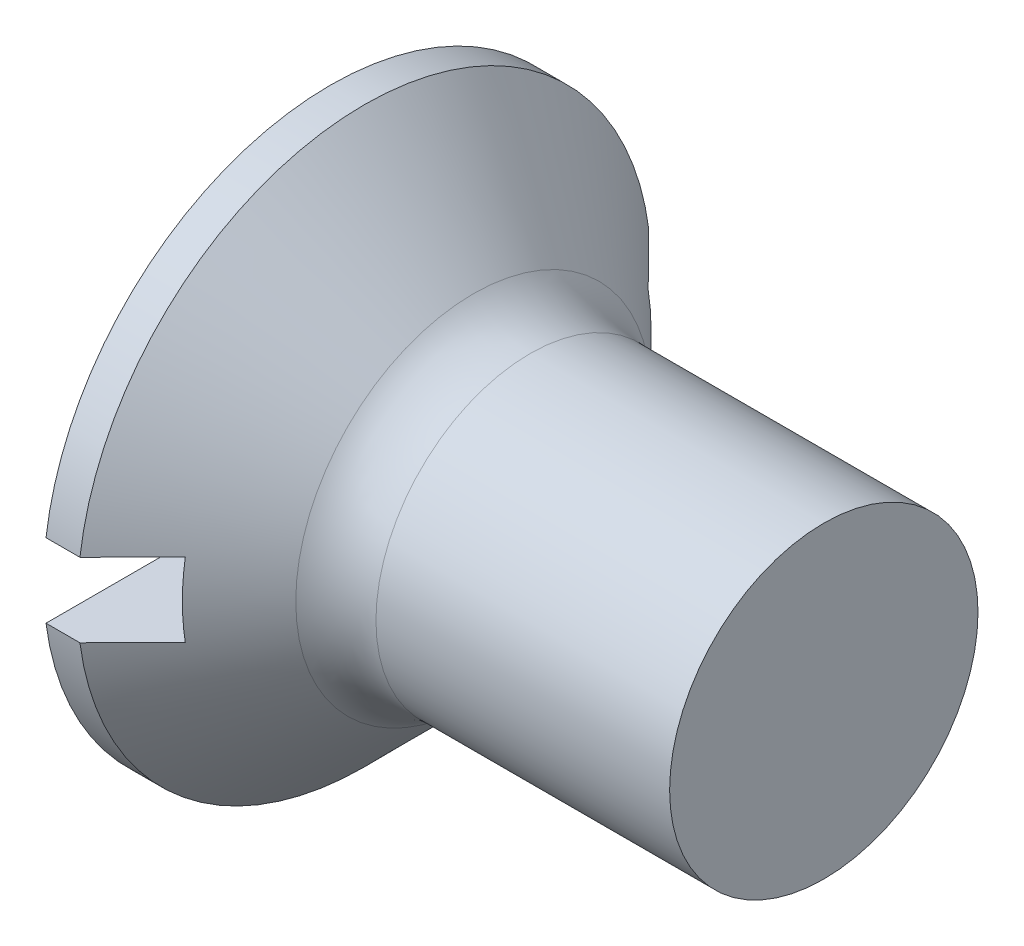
from build123d import *

# Parameters (mm, degrees)
FILLET1_R  = 1.3
SKETCH2_W  = 9.3
SKETCH2_H  = 1.2
SLOT_DEPTH = 1.4


with BuildPart() as part:
    # BodySke → Base-Revolve (revolve)
    with BuildSketch(Plane.XY, mode=Mode.PRIVATE) as base_revolve_sk:
        Polygon((0, 0), (0, 4.65), (0.55, 4.65), (2.7, 2.5), (8, 2.5), (8, 0), align=None)
    revolve(base_revolve_sk.sketch.rotate(Axis((-6.35, 0, 0), (1, 0, 0)), 90), axis=Axis((-6.35, 0, 0), (1, 0, 0)))

    # Fillet1
    fillet1_edges = [part.edges().sort_by_distance(p)[0] for p in [
        (2.7, 0, -2.5),
    ]]
    fillet(fillet1_edges, radius=FILLET1_R)

    # Sketch2 → Slot (cut)
    with BuildSketch(Plane.ZY):
        Rectangle(SKETCH2_W, SKETCH2_H)
    extrude(amount=-SLOT_DEPTH, mode=Mode.SUBTRACT)


solid = part.part
